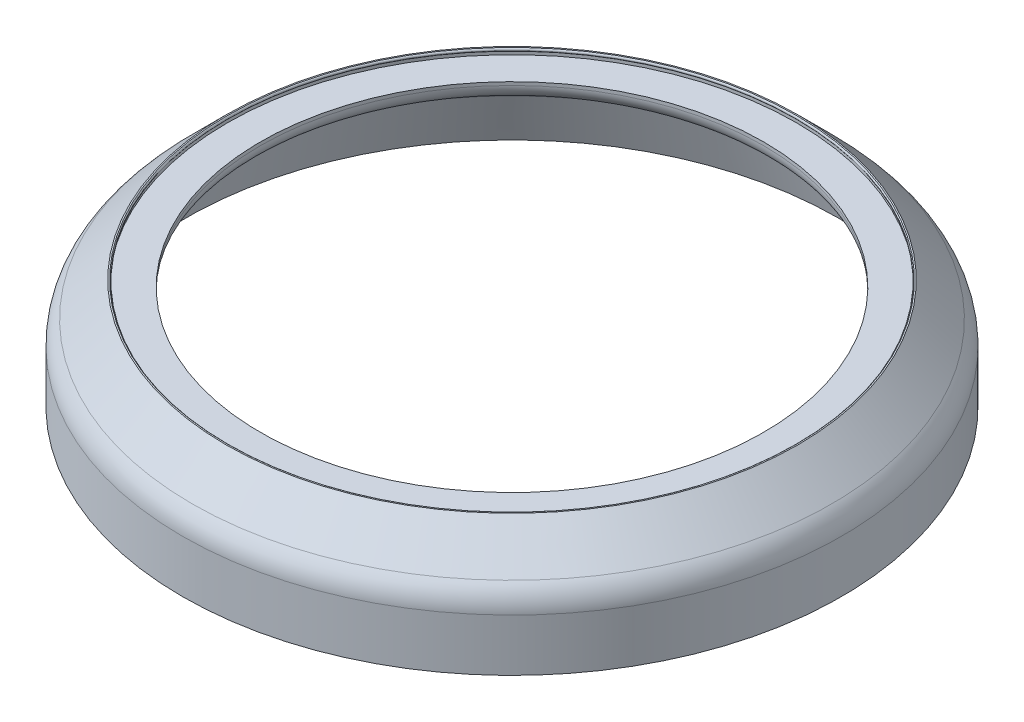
ISO-10303-21;
HEADER;
FILE_DESCRIPTION(('STEP AP214'),'2;1');
FILE_NAME('part.step','',(''),(''),'','','');
FILE_SCHEMA(('AUTOMOTIVE_DESIGN { 1 0 10303 214 1 1 1 1 }'));
ENDSEC;
DATA;
#1=APPLICATION_CONTEXT('core data for automotive mechanical design processes');
#2=APPLICATION_PROTOCOL_DEFINITION('international standard','automotive_design',2000,#1);
#3=PRODUCT_CONTEXT('',#1,'mechanical');
#4=PRODUCT('Part','Part','',(#3));
#5=PRODUCT_RELATED_PRODUCT_CATEGORY('part','',(#4));
#6=PRODUCT_DEFINITION_FORMATION('','',#4);
#7=PRODUCT_DEFINITION_CONTEXT('part definition',#1,'design');
#8=PRODUCT_DEFINITION('design','',#6,#7);
#9=PRODUCT_DEFINITION_SHAPE('','',#8);
#10=(LENGTH_UNIT() NAMED_UNIT(*) SI_UNIT(.MILLI.,.METRE.));
#11=(NAMED_UNIT(*) PLANE_ANGLE_UNIT() SI_UNIT($,.RADIAN.));
#12=(NAMED_UNIT(*) SI_UNIT($,.STERADIAN.) SOLID_ANGLE_UNIT());
#13=UNCERTAINTY_MEASURE_WITH_UNIT(LENGTH_MEASURE(1.E-05),#10,'distance_accuracy_value','');
#14=(GEOMETRIC_REPRESENTATION_CONTEXT(3) GLOBAL_UNCERTAINTY_ASSIGNED_CONTEXT((#13)) GLOBAL_UNIT_ASSIGNED_CONTEXT((#10,
#11,#12)) REPRESENTATION_CONTEXT('',''));
#15=CARTESIAN_POINT('',(0.,0.,0.));
#16=DIRECTION('',(0.,0.,1.));
#17=DIRECTION('',(1.,0.,0.));
#18=AXIS2_PLACEMENT_3D('',#15,#16,#17);
#19=CARTESIAN_POINT('',(-127.,-39.8075516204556,0.));
#20=DIRECTION('',(0.,1.,0.));
#21=DIRECTION('',(0.,0.,1.));
#22=AXIS2_PLACEMENT_3D('',#19,#20,#21);
#23=PLANE('',#22);
#24=CARTESIAN_POINT('',(0.,-39.8075516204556,0.));
#25=DIRECTION('',(0.,-1.,0.));
#26=DIRECTION('',(0.,0.,-1.));
#27=AXIS2_PLACEMENT_3D('',#24,#25,#26);
#28=CIRCLE('',#27,125.73);
#29=CARTESIAN_POINT('',(0.,-39.8075516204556,-125.73));
#30=VERTEX_POINT('',#29);
#31=EDGE_CURVE('E69',#30,#30,#28,.T.);
#32=ORIENTED_EDGE('',*,*,#31,.F.);
#33=EDGE_LOOP('',(#32));
#34=FACE_BOUND('',#33,.T.);
#35=CARTESIAN_POINT('',(0.,-39.8075516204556,0.));
#36=DIRECTION('',(0.,-1.,0.));
#37=DIRECTION('',(0.,0.,-1.));
#38=AXIS2_PLACEMENT_3D('',#35,#36,#37);
#39=CIRCLE('',#38,127.);
#40=CARTESIAN_POINT('',(0.,-39.8075516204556,-127.));
#41=VERTEX_POINT('',#40);
#42=EDGE_CURVE('E90',#41,#41,#39,.T.);
#43=ORIENTED_EDGE('',*,*,#42,.T.);
#44=EDGE_LOOP('',(#43));
#45=FACE_BOUND('',#44,.T.);
#46=ADVANCED_FACE('F31',(#34,#45),#23,.F.);
#47=CARTESIAN_POINT('',(0.,-39.8075516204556,0.));
#48=DIRECTION('',(0.,-1.,0.));
#49=DIRECTION('',(0.,0.,-1.));
#50=AXIS2_PLACEMENT_3D('',#47,#48,#49);
#51=CONICAL_SURFACE('',#50,125.73,0.261799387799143);
#52=CARTESIAN_POINT('',(0.,-21.6562410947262,0.));
#53=DIRECTION('',(0.,1.,0.));
#54=DIRECTION('',(0.,0.,1.));
#55=AXIS2_PLACEMENT_3D('',#52,#53,#54);
#56=CIRCLE('',#55,120.866371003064);
#57=CARTESIAN_POINT('',(0.,-21.6562410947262,120.866371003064));
#58=VERTEX_POINT('',#57);
#59=EDGE_CURVE('E10',#58,#58,#56,.T.);
#60=ORIENTED_EDGE('',*,*,#59,.T.);
#61=EDGE_LOOP('',(#60));
#62=FACE_BOUND('',#61,.T.);
#63=ORIENTED_EDGE('',*,*,#31,.T.);
#64=EDGE_LOOP('',(#63));
#65=FACE_BOUND('',#64,.T.);
#66=ADVANCED_FACE('F112',(#62,#65),#51,.F.);
#67=CARTESIAN_POINT('',(0.,0.,0.));
#68=DIRECTION('',(0.,-1.,0.));
#69=DIRECTION('',(0.,0.,-1.));
#70=AXIS2_PLACEMENT_3D('',#67,#68,#69);
#71=CYLINDRICAL_SURFACE('',#70,120.65);
#72=CARTESIAN_POINT('',(0.,-20.0127401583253,0.));
#73=DIRECTION('',(0.,1.,0.));
#74=DIRECTION('',(0.,0.,1.));
#75=AXIS2_PLACEMENT_3D('',#72,#73,#74);
#76=CIRCLE('',#75,120.65);
#77=CARTESIAN_POINT('',(0.,-20.0127401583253,120.65));
#78=VERTEX_POINT('',#77);
#79=EDGE_CURVE('E38',#78,#78,#76,.F.);
#80=ORIENTED_EDGE('',*,*,#79,.T.);
#81=EDGE_LOOP('',(#80));
#82=FACE_BOUND('',#81,.T.);
#83=CARTESIAN_POINT('',(0.,-19.668063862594,0.));
#84=DIRECTION('',(0.,-1.,0.));
#85=DIRECTION('',(0.,0.,-1.));
#86=AXIS2_PLACEMENT_3D('',#83,#84,#85);
#87=CIRCLE('',#86,120.65);
#88=CARTESIAN_POINT('',(0.,-19.668063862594,-120.65));
#89=VERTEX_POINT('',#88);
#90=EDGE_CURVE('E42',#89,#89,#87,.F.);
#91=ORIENTED_EDGE('',*,*,#90,.T.);
#92=EDGE_LOOP('',(#91));
#93=FACE_BOUND('',#92,.T.);
#94=ADVANCED_FACE('F118',(#82,#93),#71,.F.);
#95=CARTESIAN_POINT('',(0.,-17.0378077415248,0.));
#96=DIRECTION('',(0.,-1.,0.));
#97=DIRECTION('',(0.,0.,-1.));
#98=AXIS2_PLACEMENT_3D('',#95,#96,#97);
#99=CONICAL_SURFACE('',#98,120.65,0.78539816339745);
#100=CARTESIAN_POINT('',(0.,-9.47987193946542,0.));
#101=DIRECTION('',(0.,-1.,0.));
#102=DIRECTION('',(0.,0.,-1.));
#103=AXIS2_PLACEMENT_3D('',#100,#101,#102);
#104=CIRCLE('',#103,113.092064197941);
#105=CARTESIAN_POINT('',(0.,-9.47987193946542,-113.092064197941));
#106=VERTEX_POINT('',#105);
#107=EDGE_CURVE('E46',#106,#106,#104,.F.);
#108=ORIENTED_EDGE('',*,*,#107,.T.);
#109=EDGE_LOOP('',(#108));
#110=FACE_BOUND('',#109,.T.);
#111=CARTESIAN_POINT('',(0.,-15.1779358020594,0.));
#112=DIRECTION('',(0.,-1.,0.));
#113=DIRECTION('',(0.,0.,-1.));
#114=AXIS2_PLACEMENT_3D('',#111,#112,#113);
#115=CIRCLE('',#114,118.790128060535);
#116=CARTESIAN_POINT('',(0.,-15.1779358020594,-118.790128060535));
#117=VERTEX_POINT('',#116);
#118=EDGE_CURVE('E51',#117,#117,#115,.T.);
#119=ORIENTED_EDGE('',*,*,#118,.T.);
#120=EDGE_LOOP('',(#119));
#121=FACE_BOUND('',#120,.T.);
#122=ADVANCED_FACE('F143',(#110,#121),#99,.F.);
#123=CARTESIAN_POINT('',(-111.232192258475,-7.62,0.));
#124=DIRECTION('',(0.,1.,0.));
#125=DIRECTION('',(0.,0.,1.));
#126=AXIS2_PLACEMENT_3D('',#123,#124,#125);
#127=PLANE('',#126);
#128=CARTESIAN_POINT('',(0.,-7.62,0.));
#129=DIRECTION('',(0.,1.,0.));
#130=DIRECTION('',(0.,0.,1.));
#131=AXIS2_PLACEMENT_3D('',#128,#129,#130);
#132=CIRCLE('',#131,103.3145);
#133=CARTESIAN_POINT('',(0.,-7.62,103.3145));
#134=VERTEX_POINT('',#133);
#135=EDGE_CURVE('E54',#134,#134,#132,.T.);
#136=ORIENTED_EDGE('',*,*,#135,.T.);
#137=EDGE_LOOP('',(#136));
#138=FACE_BOUND('',#137,.T.);
#139=CARTESIAN_POINT('',(0.,-7.62,0.));
#140=DIRECTION('',(0.,1.,0.));
#141=DIRECTION('',(0.,0.,1.));
#142=AXIS2_PLACEMENT_3D('',#139,#140,#141);
#143=CIRCLE('',#142,108.601936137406);
#144=CARTESIAN_POINT('',(0.,-7.62,108.601936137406));
#145=VERTEX_POINT('',#144);
#146=EDGE_CURVE('E57',#145,#145,#143,.F.);
#147=ORIENTED_EDGE('',*,*,#146,.T.);
#148=EDGE_LOOP('',(#147));
#149=FACE_BOUND('',#148,.T.);
#150=ADVANCED_FACE('F145',(#138,#149),#127,.F.);
#151=CARTESIAN_POINT('',(0.,0.,0.));
#152=DIRECTION('',(0.,-1.,0.));
#153=DIRECTION('',(0.,0.,-1.));
#154=AXIS2_PLACEMENT_3D('',#151,#152,#153);
#155=CYLINDRICAL_SURFACE('',#154,96.9645);
#156=CARTESIAN_POINT('',(0.,-1.27,0.));
#157=DIRECTION('',(0.,1.,0.));
#158=DIRECTION('',(0.,0.,1.));
#159=AXIS2_PLACEMENT_3D('',#156,#157,#158);
#160=CIRCLE('',#159,96.9645);
#161=CARTESIAN_POINT('',(0.,-1.27,96.9645));
#162=VERTEX_POINT('',#161);
#163=EDGE_CURVE('E60',#162,#162,#160,.F.);
#164=ORIENTED_EDGE('',*,*,#163,.T.);
#165=EDGE_LOOP('',(#164));
#166=FACE_BOUND('',#165,.T.);
#167=CARTESIAN_POINT('',(0.,0.,0.));
#168=DIRECTION('',(0.,-1.,0.));
#169=DIRECTION('',(0.,0.,-1.));
#170=AXIS2_PLACEMENT_3D('',#167,#168,#169);
#171=CIRCLE('',#170,96.9645);
#172=CARTESIAN_POINT('',(0.,0.,-96.9645));
#173=VERTEX_POINT('',#172);
#174=EDGE_CURVE('E72',#173,#173,#171,.T.);
#175=ORIENTED_EDGE('',*,*,#174,.F.);
#176=EDGE_LOOP('',(#175));
#177=FACE_BOUND('',#176,.T.);
#178=ADVANCED_FACE('F152',(#166,#177),#155,.F.);
#179=CARTESIAN_POINT('',(-96.9645,0.,0.));
#180=DIRECTION('',(0.,-1.,0.));
#181=DIRECTION('',(0.,0.,-1.));
#182=AXIS2_PLACEMENT_3D('',#179,#180,#181);
#183=PLANE('',#182);
#184=CARTESIAN_POINT('',(0.,0.,0.));
#185=DIRECTION('',(0.,-1.,0.));
#186=DIRECTION('',(0.,0.,-1.));
#187=AXIS2_PLACEMENT_3D('',#184,#185,#186);
#188=CIRCLE('',#187,109.6645);
#189=CARTESIAN_POINT('',(0.,0.,-109.6645));
#190=VERTEX_POINT('',#189);
#191=EDGE_CURVE('E75',#190,#190,#188,.T.);
#192=ORIENTED_EDGE('',*,*,#191,.F.);
#193=EDGE_LOOP('',(#192));
#194=FACE_BOUND('',#193,.T.);
#195=ORIENTED_EDGE('',*,*,#174,.T.);
#196=EDGE_LOOP('',(#195));
#197=FACE_BOUND('',#196,.T.);
#198=ADVANCED_FACE('F158',(#194,#197),#183,.F.);
#199=CARTESIAN_POINT('',(0.,0.,0.));
#200=DIRECTION('',(0.,-1.,0.));
#201=DIRECTION('',(0.,0.,-1.));
#202=AXIS2_PLACEMENT_3D('',#199,#200,#201);
#203=CYLINDRICAL_SURFACE('',#202,109.6645);
#204=CARTESIAN_POINT('',(0.,1.17804990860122,0.));
#205=DIRECTION('',(0.,-1.,0.));
#206=DIRECTION('',(0.,0.,-1.));
#207=AXIS2_PLACEMENT_3D('',#204,#205,#206);
#208=CIRCLE('',#207,109.6645);
#209=CARTESIAN_POINT('',(0.,1.17804990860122,-109.6645));
#210=VERTEX_POINT('',#209);
#211=EDGE_CURVE('E78',#210,#210,#208,.T.);
#212=ORIENTED_EDGE('',*,*,#211,.F.);
#213=EDGE_LOOP('',(#212));
#214=FACE_BOUND('',#213,.T.);
#215=ORIENTED_EDGE('',*,*,#191,.T.);
#216=EDGE_LOOP('',(#215));
#217=FACE_BOUND('',#216,.T.);
#218=ADVANCED_FACE('F162',(#214,#217),#203,.F.);
#219=CARTESIAN_POINT('',(0.,1.17804990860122,0.));
#220=DIRECTION('',(0.,-1.,0.));
#221=DIRECTION('',(0.,0.,-1.));
#222=AXIS2_PLACEMENT_3D('',#219,#220,#221);
#223=TOROIDAL_SURFACE('',#222,109.5375,0.127000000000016);
#224=CARTESIAN_POINT('',(0.,1.28803513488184,0.));
#225=DIRECTION('',(0.,-1.,0.));
#226=DIRECTION('',(0.,0.,-1.));
#227=AXIS2_PLACEMENT_3D('',#224,#225,#226);
#228=CIRCLE('',#227,109.601);
#229=CARTESIAN_POINT('',(0.,1.28803513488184,-109.601));
#230=VERTEX_POINT('',#229);
#231=EDGE_CURVE('E81',#230,#230,#228,.T.);
#232=ORIENTED_EDGE('',*,*,#231,.F.);
#233=EDGE_LOOP('',(#232));
#234=FACE_BOUND('',#233,.T.);
#235=ORIENTED_EDGE('',*,*,#211,.T.);
#236=EDGE_LOOP('',(#235));
#237=FACE_BOUND('',#236,.T.);
#238=ADVANCED_FACE('F166',(#234,#237),#223,.F.);
#239=CARTESIAN_POINT('',(0.,1.83796126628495,0.));
#240=DIRECTION('',(0.,-1.,0.));
#241=DIRECTION('',(0.,0.,-1.));
#242=AXIS2_PLACEMENT_3D('',#239,#240,#241);
#243=TOROIDAL_SURFACE('',#242,109.9185,0.634999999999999);
#244=CARTESIAN_POINT('',(0.,2.41994837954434,0.));
#245=DIRECTION('',(0.,-1.,0.));
#246=DIRECTION('',(0.,0.,-1.));
#247=AXIS2_PLACEMENT_3D('',#244,#245,#246);
#248=CIRCLE('',#247,109.6645);
#249=CARTESIAN_POINT('',(0.,2.41994837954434,-109.6645));
#250=VERTEX_POINT('',#249);
#251=EDGE_CURVE('E84',#250,#250,#248,.T.);
#252=ORIENTED_EDGE('',*,*,#251,.F.);
#253=EDGE_LOOP('',(#252));
#254=FACE_BOUND('',#253,.T.);
#255=ORIENTED_EDGE('',*,*,#231,.T.);
#256=EDGE_LOOP('',(#255));
#257=FACE_BOUND('',#256,.T.);
#258=ADVANCED_FACE('F170',(#254,#257),#243,.T.);
#259=CARTESIAN_POINT('',(-109.6645,2.41994837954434,0.));
#260=DIRECTION('',(0.,-1.,0.));
#261=DIRECTION('',(0.,0.,-1.));
#262=AXIS2_PLACEMENT_3D('',#259,#260,#261);
#263=PLANE('',#262);
#264=CARTESIAN_POINT('',(0.,2.41994837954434,0.));
#265=DIRECTION('',(0.,-1.,0.));
#266=DIRECTION('',(0.,0.,-1.));
#267=AXIS2_PLACEMENT_3D('',#264,#265,#266);
#268=CIRCLE('',#267,110.1725);
#269=CARTESIAN_POINT('',(0.,2.41994837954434,-110.1725));
#270=VERTEX_POINT('',#269);
#271=EDGE_CURVE('E87',#270,#270,#268,.T.);
#272=ORIENTED_EDGE('',*,*,#271,.F.);
#273=EDGE_LOOP('',(#272));
#274=FACE_BOUND('',#273,.T.);
#275=ORIENTED_EDGE('',*,*,#251,.T.);
#276=EDGE_LOOP('',(#275));
#277=FACE_BOUND('',#276,.T.);
#278=ADVANCED_FACE('F108',(#274,#277),#263,.F.);
#279=CARTESIAN_POINT('',(0.,2.41994837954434,0.));
#280=DIRECTION('',(0.,-1.,0.));
#281=DIRECTION('',(0.,0.,-1.));
#282=AXIS2_PLACEMENT_3D('',#279,#280,#281);
#283=CONICAL_SURFACE('',#282,110.1725,0.785398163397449);
#284=CARTESIAN_POINT('',(0.,-10.6878077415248,0.));
#285=DIRECTION('',(0.,1.,0.));
#286=DIRECTION('',(0.,0.,1.));
#287=AXIS2_PLACEMENT_3D('',#284,#285,#286);
#288=CIRCLE('',#287,123.280256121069);
#289=CARTESIAN_POINT('',(0.,-10.6878077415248,123.280256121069));
#290=VERTEX_POINT('',#289);
#291=EDGE_CURVE('E63',#290,#290,#288,.T.);
#292=ORIENTED_EDGE('',*,*,#291,.T.);
#293=EDGE_LOOP('',(#292));
#294=FACE_BOUND('',#293,.T.);
#295=ORIENTED_EDGE('',*,*,#271,.T.);
#296=EDGE_LOOP('',(#295));
#297=FACE_BOUND('',#296,.T.);
#298=ADVANCED_FACE('F98',(#294,#297),#283,.T.);
#299=CARTESIAN_POINT('',(0.,0.,0.));
#300=DIRECTION('',(0.,-1.,0.));
#301=DIRECTION('',(0.,0.,-1.));
#302=AXIS2_PLACEMENT_3D('',#299,#300,#301);
#303=CYLINDRICAL_SURFACE('',#302,127.);
#304=CARTESIAN_POINT('',(0.,-19.668063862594,0.));
#305=DIRECTION('',(0.,1.,0.));
#306=DIRECTION('',(0.,0.,1.));
#307=AXIS2_PLACEMENT_3D('',#304,#305,#306);
#308=CIRCLE('',#307,127.);
#309=CARTESIAN_POINT('',(0.,-19.668063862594,127.));
#310=VERTEX_POINT('',#309);
#311=EDGE_CURVE('E66',#310,#310,#308,.F.);
#312=ORIENTED_EDGE('',*,*,#311,.T.);
#313=EDGE_LOOP('',(#312));
#314=FACE_BOUND('',#313,.T.);
#315=ORIENTED_EDGE('',*,*,#42,.F.);
#316=EDGE_LOOP('',(#315));
#317=FACE_BOUND('',#316,.T.);
#318=ADVANCED_FACE('F95',(#314,#317),#303,.T.);
#319=CARTESIAN_POINT('',(0.,-19.668063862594,0.));
#320=DIRECTION('',(0.,1.,0.));
#321=DIRECTION('',(0.,0.,1.));
#322=AXIS2_PLACEMENT_3D('',#319,#320,#321);
#323=TOROIDAL_SURFACE('',#322,114.3,12.7);
#324=ORIENTED_EDGE('',*,*,#291,.F.);
#325=EDGE_LOOP('',(#324));
#326=FACE_BOUND('',#325,.T.);
#327=ORIENTED_EDGE('',*,*,#311,.F.);
#328=EDGE_LOOP('',(#327));
#329=FACE_BOUND('',#328,.T.);
#330=ADVANCED_FACE('F97',(#326,#329),#323,.T.);
#331=CARTESIAN_POINT('',(0.,-1.27,0.));
#332=DIRECTION('',(0.,1.,0.));
#333=DIRECTION('',(0.,0.,1.));
#334=AXIS2_PLACEMENT_3D('',#331,#332,#333);
#335=TOROIDAL_SURFACE('',#334,103.3145,6.35);
#336=ORIENTED_EDGE('',*,*,#135,.F.);
#337=EDGE_LOOP('',(#336));
#338=FACE_BOUND('',#337,.T.);
#339=ORIENTED_EDGE('',*,*,#163,.F.);
#340=EDGE_LOOP('',(#339));
#341=FACE_BOUND('',#340,.T.);
#342=ADVANCED_FACE('F105',(#338,#341),#335,.T.);
#343=CARTESIAN_POINT('',(0.,-13.97,0.));
#344=DIRECTION('',(0.,1.,0.));
#345=DIRECTION('',(0.,0.,1.));
#346=AXIS2_PLACEMENT_3D('',#343,#344,#345);
#347=TOROIDAL_SURFACE('',#346,108.601936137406,6.35);
#348=ORIENTED_EDGE('',*,*,#107,.F.);
#349=EDGE_LOOP('',(#348));
#350=FACE_BOUND('',#349,.T.);
#351=ORIENTED_EDGE('',*,*,#146,.F.);
#352=EDGE_LOOP('',(#351));
#353=FACE_BOUND('',#352,.T.);
#354=ADVANCED_FACE('F125',(#350,#353),#347,.F.);
#355=CARTESIAN_POINT('',(0.,-20.0127401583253,0.));
#356=DIRECTION('',(0.,1.,0.));
#357=DIRECTION('',(0.,0.,1.));
#358=AXIS2_PLACEMENT_3D('',#355,#356,#357);
#359=TOROIDAL_SURFACE('',#358,127.,6.35);
#360=ORIENTED_EDGE('',*,*,#59,.F.);
#361=EDGE_LOOP('',(#360));
#362=FACE_BOUND('',#361,.T.);
#363=ORIENTED_EDGE('',*,*,#79,.F.);
#364=EDGE_LOOP('',(#363));
#365=FACE_BOUND('',#364,.T.);
#366=ADVANCED_FACE('F128',(#362,#365),#359,.T.);
#367=CARTESIAN_POINT('',(0.,-19.668063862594,0.));
#368=DIRECTION('',(0.,-1.,0.));
#369=DIRECTION('',(0.,0.,-1.));
#370=AXIS2_PLACEMENT_3D('',#367,#368,#369);
#371=TOROIDAL_SURFACE('',#370,114.3,6.35);
#372=ORIENTED_EDGE('',*,*,#90,.F.);
#373=EDGE_LOOP('',(#372));
#374=FACE_BOUND('',#373,.T.);
#375=ORIENTED_EDGE('',*,*,#118,.F.);
#376=EDGE_LOOP('',(#375));
#377=FACE_BOUND('',#376,.T.);
#378=ADVANCED_FACE('F33',(#374,#377),#371,.F.);
#379=CLOSED_SHELL('',(#46,#66,#94,#122,#150,#178,#198,#218,#238,#258,#278,#298,#318,#330,#342,
#354,#366,#378));
#380=MANIFOLD_SOLID_BREP('B2',#379);
#381=ADVANCED_BREP_SHAPE_REPRESENTATION('',(#18,#380),#14);
#382=SHAPE_DEFINITION_REPRESENTATION(#9,#381);
ENDSEC;
END-ISO-10303-21;
